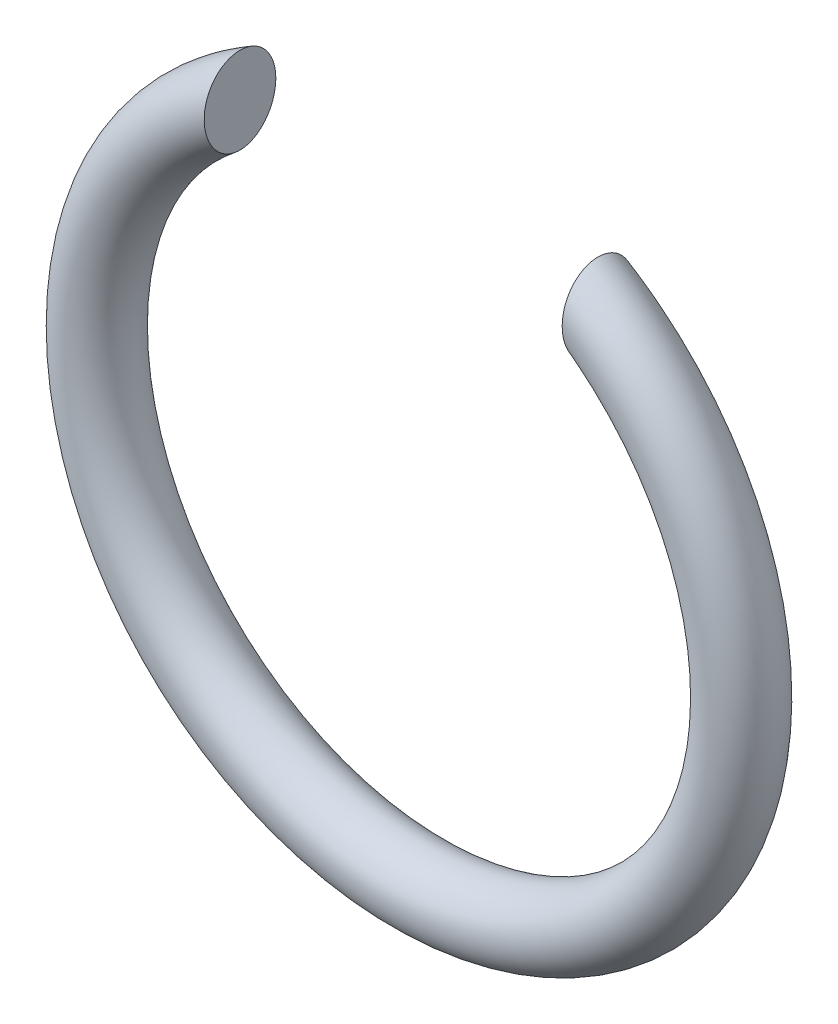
ISO-10303-21;
HEADER;
FILE_DESCRIPTION(('STEP AP214'),'2;1');
FILE_NAME('part.step','',(''),(''),'','','');
FILE_SCHEMA(('AUTOMOTIVE_DESIGN { 1 0 10303 214 1 1 1 1 }'));
ENDSEC;
DATA;
#1=APPLICATION_CONTEXT('core data for automotive mechanical design processes');
#2=APPLICATION_PROTOCOL_DEFINITION('international standard','automotive_design',2000,#1);
#3=PRODUCT_CONTEXT('',#1,'mechanical');
#4=PRODUCT('Part','Part','',(#3));
#5=PRODUCT_RELATED_PRODUCT_CATEGORY('part','',(#4));
#6=PRODUCT_DEFINITION_FORMATION('','',#4);
#7=PRODUCT_DEFINITION_CONTEXT('part definition',#1,'design');
#8=PRODUCT_DEFINITION('design','',#6,#7);
#9=PRODUCT_DEFINITION_SHAPE('','',#8);
#10=(LENGTH_UNIT() NAMED_UNIT(*) SI_UNIT(.MILLI.,.METRE.));
#11=(NAMED_UNIT(*) PLANE_ANGLE_UNIT() SI_UNIT($,.RADIAN.));
#12=(NAMED_UNIT(*) SI_UNIT($,.STERADIAN.) SOLID_ANGLE_UNIT());
#13=UNCERTAINTY_MEASURE_WITH_UNIT(LENGTH_MEASURE(1.E-05),#10,'distance_accuracy_value','');
#14=(GEOMETRIC_REPRESENTATION_CONTEXT(3) GLOBAL_UNCERTAINTY_ASSIGNED_CONTEXT((#13)) GLOBAL_UNIT_ASSIGNED_CONTEXT((#10,
#11,#12)) REPRESENTATION_CONTEXT('',''));
#15=CARTESIAN_POINT('',(0.,0.,0.));
#16=DIRECTION('',(0.,0.,1.));
#17=DIRECTION('',(1.,0.,0.));
#18=AXIS2_PLACEMENT_3D('',#15,#16,#17);
#19=CARTESIAN_POINT('',(0.,0.,0.));
#20=DIRECTION('',(0.,0.,-1.));
#21=DIRECTION('',(-1.,0.,0.));
#22=AXIS2_PLACEMENT_3D('',#19,#20,#21);
#23=TOROIDAL_SURFACE('',#22,3.6,0.4);
#24=CARTESIAN_POINT('',(2.,2.56295612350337,-0.195375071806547));
#25=CARTESIAN_POINT('',(2.,2.57790808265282,-0.216432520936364));
#26=CARTESIAN_POINT('',(2.,2.59494628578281,-0.236019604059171));
#27=CARTESIAN_POINT('',(2.,2.63214645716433,-0.271971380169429));
#28=CARTESIAN_POINT('',(2.,2.6523150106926,-0.288329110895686));
#29=CARTESIAN_POINT('',(2.,2.69475225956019,-0.3176080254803));
#30=CARTESIAN_POINT('',(2.,2.71700289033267,-0.330555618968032));
#31=CARTESIAN_POINT('',(2.,2.76308641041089,-0.353168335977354));
#32=CARTESIAN_POINT('',(2.,2.78691867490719,-0.362834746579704));
#33=CARTESIAN_POINT('',(2.,2.8399586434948,-0.380299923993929));
#34=CARTESIAN_POINT('',(2.,2.86937431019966,-0.387470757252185));
#35=CARTESIAN_POINT('',(2.,2.92897400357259,-0.397212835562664));
#36=CARTESIAN_POINT('',(2.,2.9591586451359,-0.39978027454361));
#37=CARTESIAN_POINT('',(2.,3.02213545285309,-0.400210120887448));
#38=CARTESIAN_POINT('',(2.,3.0549319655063,-0.397655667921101));
#39=CARTESIAN_POINT('',(2.,3.11958843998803,-0.386797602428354));
#40=CARTESIAN_POINT('',(2.,3.1514482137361,-0.378492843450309));
#41=CARTESIAN_POINT('',(2.,3.21154235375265,-0.356527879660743));
#42=CARTESIAN_POINT('',(2.,3.23987755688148,-0.343146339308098));
#43=CARTESIAN_POINT('',(2.,3.29333178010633,-0.311044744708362));
#44=CARTESIAN_POINT('',(2.,3.31845775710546,-0.292336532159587));
#45=CARTESIAN_POINT('',(2.,3.35743701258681,-0.25606439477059));
#46=CARTESIAN_POINT('',(2.,3.37244824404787,-0.239736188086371));
#47=CARTESIAN_POINT('',(2.,3.3995566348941,-0.204809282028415));
#48=CARTESIAN_POINT('',(2.,3.41165551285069,-0.186211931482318));
#49=CARTESIAN_POINT('',(2.,3.43244009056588,-0.147067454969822));
#50=CARTESIAN_POINT('',(2.,3.44110849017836,-0.126511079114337));
#51=CARTESIAN_POINT('',(2.,3.45447566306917,-0.0841416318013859));
#52=CARTESIAN_POINT('',(2.,3.45917601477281,-0.0623290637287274));
#53=CARTESIAN_POINT('',(2.,3.4640996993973,-0.0202111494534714));
#54=CARTESIAN_POINT('',(2.,3.46468974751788,5.19216316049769E-05));
#55=CARTESIAN_POINT('',(2.,3.46233366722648,0.0403674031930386));
#56=CARTESIAN_POINT('',(2.,3.45938845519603,0.0604198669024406));
#57=CARTESIAN_POINT('',(2.,3.45026212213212,0.0990828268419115));
#58=CARTESIAN_POINT('',(2.,3.44418853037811,0.117718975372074));
#59=CARTESIAN_POINT('',(2.,3.42913861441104,0.153774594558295));
#60=CARTESIAN_POINT('',(2.,3.42016193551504,0.171193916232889));
#61=CARTESIAN_POINT('',(2.,3.39916253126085,0.205252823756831));
#62=CARTESIAN_POINT('',(2.,3.38701400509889,0.221814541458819));
#63=CARTESIAN_POINT('',(2.,3.36036219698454,0.252913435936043));
#64=CARTESIAN_POINT('',(2.,3.34585805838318,0.267449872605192));
#65=CARTESIAN_POINT('',(2.,3.31325922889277,0.295784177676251));
#66=CARTESIAN_POINT('',(2.,3.29494557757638,0.309329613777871));
#67=CARTESIAN_POINT('',(2.,3.25654242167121,0.333601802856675));
#68=CARTESIAN_POINT('',(2.,3.23645203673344,0.344327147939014));
#69=CARTESIAN_POINT('',(2.,3.192029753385,0.36426690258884));
#70=CARTESIAN_POINT('',(2.,3.16750230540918,0.373045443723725));
#71=CARTESIAN_POINT('',(2.,3.11743460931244,0.386934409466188));
#72=CARTESIAN_POINT('',(2.,3.09189386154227,0.392043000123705));
#73=CARTESIAN_POINT('',(2.,3.03666174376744,0.399150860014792));
#74=CARTESIAN_POINT('',(2.,3.00689917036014,0.400600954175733));
#75=CARTESIAN_POINT('',(2.,2.94748721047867,0.39894983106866));
#76=CARTESIAN_POINT('',(2.,2.91783793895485,0.395844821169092));
#77=CARTESIAN_POINT('',(2.,2.85658757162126,0.384677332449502));
#78=CARTESIAN_POINT('',(2.,2.82506548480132,0.376175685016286));
#79=CARTESIAN_POINT('',(2.,2.76393176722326,0.353901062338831));
#80=CARTESIAN_POINT('',(2.,2.73431915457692,0.340130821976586));
#81=CARTESIAN_POINT('',(2.,2.68402694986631,0.310781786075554));
#82=CARTESIAN_POINT('',(2.,2.66277421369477,0.296183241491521));
#83=CARTESIAN_POINT('',(2.,2.62291110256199,0.263739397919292));
#84=CARTESIAN_POINT('',(2.,2.60429692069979,0.245898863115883));
#85=CARTESIAN_POINT('',(2.,2.57386531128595,0.21085445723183));
#86=CARTESIAN_POINT('',(2.,2.56142927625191,0.19418906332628));
#87=CARTESIAN_POINT('',(2.,2.53944863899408,0.159035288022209));
#88=CARTESIAN_POINT('',(2.,2.52990262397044,0.140547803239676));
#89=CARTESIAN_POINT('',(2.,2.51423652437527,0.10198623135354));
#90=CARTESIAN_POINT('',(2.,2.50814360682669,0.0819009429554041));
#91=CARTESIAN_POINT('',(2.,2.50000006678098,0.0409268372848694));
#92=CARTESIAN_POINT('',(2.,2.49794604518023,0.0200387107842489));
#93=CARTESIAN_POINT('',(2.,2.49804753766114,-0.0189975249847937));
#94=CARTESIAN_POINT('',(2.,2.49969056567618,-0.0371488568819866));
#95=CARTESIAN_POINT('',(2.,2.5060466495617,-0.0728991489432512));
#96=CARTESIAN_POINT('',(2.,2.51075919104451,-0.0904982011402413));
#97=CARTESIAN_POINT('',(2.,2.52242619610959,-0.123209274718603));
#98=CARTESIAN_POINT('',(2.,2.52915089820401,-0.138404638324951));
#99=CARTESIAN_POINT('',(2.,2.54461525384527,-0.167727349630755));
#100=CARTESIAN_POINT('',(2.,2.55335563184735,-0.18185431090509));
#101=CARTESIAN_POINT('',(2.,2.56295612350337,-0.195375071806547));
#102=B_SPLINE_CURVE_WITH_KNOTS('',3,(#24,#25,#26,#27,#28,#29,#30,#31,#32,#33,#34,#35,#36,#37,
#38,#39,#40,#41,#42,#43,#44,#45,#46,#47,#48,#49,#50,#51,#52,#53,#54,#55,#56,#57,#58,#59,#60,#61,
#62,#63,#64,#65,#66,#67,#68,#69,#70,#71,#72,#73,#74,#75,#76,#77,#78,#79,#80,#81,#82,#83,#84,#85,
#86,#87,#88,#89,#90,#91,#92,#93,#94,#95,#96,#97,#98,#99,#100,#101),.UNSPECIFIED.,.T.,.F.,(4,2,2,
2,2,2,2,2,2,2,2,2,2,2,2,2,2,2,2,2,2,2,2,2,2,2,2,2,2,2,2,2,2,2,2,2,2,2,4),(0.,0.0774046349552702,
0.154974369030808,0.231924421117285,0.308844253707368,0.399299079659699,0.489828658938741,
0.588024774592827,0.686240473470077,0.779702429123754,0.872958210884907,0.939225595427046,
1.00545377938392,1.07201182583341,1.13854338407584,1.19905306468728,1.25954706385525,
1.31808822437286,1.37663653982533,1.43800249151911,1.49939080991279,1.56745820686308,
1.63555952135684,1.71340649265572,1.79129233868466,1.88031716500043,1.96941615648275,
2.06690272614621,2.16433875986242,2.24140080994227,2.31835051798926,2.38048825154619,
2.44259555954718,2.50518494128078,2.567721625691,2.62212923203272,2.67652772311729,
2.72621051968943,2.77591120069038),.UNSPECIFIED.);
#103=CARTESIAN_POINT('',(2.,2.56295612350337,-0.195375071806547));
#104=VERTEX_POINT('',#103);
#105=EDGE_CURVE('E50',#104,#104,#102,.T.);
#106=ORIENTED_EDGE('',*,*,#105,.T.);
#107=EDGE_LOOP('',(#106));
#108=FACE_BOUND('',#107,.T.);
#109=CARTESIAN_POINT('',(-2.,2.56295612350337,-0.195375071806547));
#110=CARTESIAN_POINT('',(-2.,2.55193966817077,-0.179857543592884));
#111=CARTESIAN_POINT('',(-2.,2.54204416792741,-0.163527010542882));
#112=CARTESIAN_POINT('',(-2.,2.52496740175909,-0.129474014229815));
#113=CARTESIAN_POINT('',(-2.,2.51778852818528,-0.11175034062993));
#114=CARTESIAN_POINT('',(-2.,2.50656234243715,-0.0752266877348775));
#115=CARTESIAN_POINT('',(-2.,2.50253077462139,-0.0564217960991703));
#116=CARTESIAN_POINT('',(-2.,2.49795869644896,-0.0183982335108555));
#117=CARTESIAN_POINT('',(-2.,2.49741575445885,0.000820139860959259));
#118=CARTESIAN_POINT('',(-2.,2.49977165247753,0.03772719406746));
#119=CARTESIAN_POINT('',(-2.,2.50243954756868,0.0554312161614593));
#120=CARTESIAN_POINT('',(-2.,2.51065979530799,0.0901533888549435));
#121=CARTESIAN_POINT('',(-2.,2.5162128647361,0.107171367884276));
#122=CARTESIAN_POINT('',(-2.,2.53001598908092,0.140451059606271));
#123=CARTESIAN_POINT('',(-2.,2.53831608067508,0.156691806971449));
#124=CARTESIAN_POINT('',(-2.,2.55717886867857,0.187792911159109));
#125=CARTESIAN_POINT('',(-2.,2.56774239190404,0.202652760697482));
#126=CARTESIAN_POINT('',(-2.,2.59247761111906,0.232971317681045));
#127=CARTESIAN_POINT('',(-2.,2.60695333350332,0.248181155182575));
#128=CARTESIAN_POINT('',(-2.,2.63785244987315,0.276466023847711));
#129=CARTESIAN_POINT('',(-2.,2.65427708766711,0.289539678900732));
#130=CARTESIAN_POINT('',(-2.,2.69223194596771,0.316023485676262));
#131=CARTESIAN_POINT('',(-2.,2.71411176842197,0.328932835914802));
#132=CARTESIAN_POINT('',(-2.,2.75945922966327,0.35156548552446));
#133=CARTESIAN_POINT('',(-2.,2.7829279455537,0.361286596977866));
#134=CARTESIAN_POINT('',(-2.,2.8354417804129,0.379047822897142));
#135=CARTESIAN_POINT('',(-2.,2.86470948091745,0.386434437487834));
#136=CARTESIAN_POINT('',(-2.,2.92403907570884,0.396639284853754));
#137=CARTESIAN_POINT('',(-2.,2.95410143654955,0.399454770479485));
#138=CARTESIAN_POINT('',(-2.,3.01695411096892,0.400443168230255));
#139=CARTESIAN_POINT('',(-2.,3.04975270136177,0.398187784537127));
#140=CARTESIAN_POINT('',(-2.,3.11447264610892,0.387944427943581));
#141=CARTESIAN_POINT('',(-2.,3.14639376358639,0.379954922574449));
#142=CARTESIAN_POINT('',(-2.,3.20678285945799,0.358579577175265));
#143=CARTESIAN_POINT('',(-2.,3.23534159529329,0.345452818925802));
#144=CARTESIAN_POINT('',(-2.,3.28929661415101,0.313822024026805));
#145=CARTESIAN_POINT('',(-2.,3.31469968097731,0.295329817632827));
#146=CARTESIAN_POINT('',(-2.,3.35421229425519,0.259363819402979));
#147=CARTESIAN_POINT('',(-2.,3.36946499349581,0.243137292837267));
#148=CARTESIAN_POINT('',(-2.,3.39707116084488,0.208372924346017));
#149=CARTESIAN_POINT('',(-2.,3.40942633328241,0.189836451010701));
#150=CARTESIAN_POINT('',(-2.,3.43073071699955,0.150764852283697));
#151=CARTESIAN_POINT('',(-2.,3.43966233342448,0.130220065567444));
#152=CARTESIAN_POINT('',(-2.,3.45354572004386,0.0878227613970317));
#153=CARTESIAN_POINT('',(-2.,3.45849913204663,0.0659707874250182));
#154=CARTESIAN_POINT('',(-2.,3.46387619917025,0.0237686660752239));
#155=CARTESIAN_POINT('',(-2.,3.46467531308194,0.00346575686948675));
#156=CARTESIAN_POINT('',(-2.,3.46271772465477,-0.0369639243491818));
#157=CARTESIAN_POINT('',(-2.,3.45996199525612,-0.0570907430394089));
#158=CARTESIAN_POINT('',(-2.,3.45119190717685,-0.0958783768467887));
#159=CARTESIAN_POINT('',(-2.,3.4452940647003,-0.114565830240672));
#160=CARTESIAN_POINT('',(-2.,3.43057922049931,-0.150748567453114));
#161=CARTESIAN_POINT('',(-2.,3.42176188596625,-0.168243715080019));
#162=CARTESIAN_POINT('',(-2.,3.40108895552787,-0.202442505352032));
#163=CARTESIAN_POINT('',(-2.,3.38911210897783,-0.219072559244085));
#164=CARTESIAN_POINT('',(-2.,3.36278839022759,-0.250330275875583));
#165=CARTESIAN_POINT('',(-2.,3.34844066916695,-0.264957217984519));
#166=CARTESIAN_POINT('',(-2.,3.31617459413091,-0.293482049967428));
#167=CARTESIAN_POINT('',(-2.,3.29803824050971,-0.307132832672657));
#168=CARTESIAN_POINT('',(-2.,3.25997155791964,-0.331638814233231));
#169=CARTESIAN_POINT('',(-2.,3.24004034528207,-0.342492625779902));
#170=CARTESIAN_POINT('',(-2.,3.19594992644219,-0.362723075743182));
#171=CARTESIAN_POINT('',(-2.,3.17159302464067,-0.371668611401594));
#172=CARTESIAN_POINT('',(-2.,3.12184035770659,-0.385916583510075));
#173=CARTESIAN_POINT('',(-2.,3.09644406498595,-0.39121714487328));
#174=CARTESIAN_POINT('',(-2.,3.04147559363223,-0.398763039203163));
#175=CARTESIAN_POINT('',(-2.,3.01182763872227,-0.400460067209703));
#176=CARTESIAN_POINT('',(-2.,2.9526087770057,-0.399326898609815));
#177=CARTESIAN_POINT('',(-2.,2.9230379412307,-0.396493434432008));
#178=CARTESIAN_POINT('',(-2.,2.86184532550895,-0.385912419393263));
#179=CARTESIAN_POINT('',(-2.,2.83029967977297,-0.377718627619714));
#180=CARTESIAN_POINT('',(-2.,2.76903789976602,-0.356068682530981));
#181=CARTESIAN_POINT('',(-2.,2.73932191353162,-0.342612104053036));
#182=CARTESIAN_POINT('',(-2.,2.68869509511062,-0.313791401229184));
#183=CARTESIAN_POINT('',(-2.,2.66723241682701,-0.299393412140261));
#184=CARTESIAN_POINT('',(-2.,2.62694629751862,-0.267359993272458));
#185=CARTESIAN_POINT('',(-2.,2.60811323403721,-0.249736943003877));
#186=CARTESIAN_POINT('',(-2.,2.58104166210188,-0.219360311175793));
#187=CARTESIAN_POINT('',(-2.,2.57164984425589,-0.207620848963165));
#188=CARTESIAN_POINT('',(-2.,2.56295612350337,-0.195375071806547));
#189=B_SPLINE_CURVE_WITH_KNOTS('',3,(#109,#110,#111,#112,#113,#114,#115,#116,#117,#118,#119,
#120,#121,#122,#123,#124,#125,#126,#127,#128,#129,#130,#131,#132,#133,#134,#135,#136,#137,#138,
#139,#140,#141,#142,#143,#144,#145,#146,#147,#148,#149,#150,#151,#152,#153,#154,#155,#156,#157,
#158,#159,#160,#161,#162,#163,#164,#165,#166,#167,#168,#169,#170,#171,#172,#173,#174,#175,#176,
#177,#178,#179,#180,#181,#182,#183,#184,#185,#186,#187,#188),.UNSPECIFIED.,.T.,.F.,(4,2,2,2,2,2,
2,2,2,2,2,2,2,2,2,2,2,2,2,2,2,2,2,2,2,2,2,2,2,2,2,2,2,2,2,2,2,2,2,4),(0.,0.0570534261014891,
0.114156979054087,0.171544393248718,0.228891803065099,0.282349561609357,0.335820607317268,
0.390324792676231,0.444848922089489,0.507612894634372,0.570417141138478,0.646348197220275,
0.722331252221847,0.812511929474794,0.902746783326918,1.00088622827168,1.0990519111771,
1.19279904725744,1.28634103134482,1.35287745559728,1.4193746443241,1.48620914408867,
1.55301604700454,1.61366476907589,1.67429689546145,1.73282291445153,1.79135560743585,
1.85258469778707,1.91383575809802,1.981666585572,2.04953099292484,2.12706912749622,
2.20464712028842,2.29336991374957,2.38215672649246,2.47947930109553,2.5768097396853,
2.6540622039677,2.73102412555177,2.77604827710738),.UNSPECIFIED.);
#190=CARTESIAN_POINT('',(-2.,2.56295612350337,-0.195375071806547));
#191=VERTEX_POINT('',#190);
#192=EDGE_CURVE('E10',#191,#191,#189,.T.);
#193=ORIENTED_EDGE('',*,*,#192,.T.);
#194=EDGE_LOOP('',(#193));
#195=FACE_BOUND('',#194,.T.);
#196=ADVANCED_FACE('F40',(#108,#195),#23,.T.);
#197=CARTESIAN_POINT('',(2.,0.,-0.4));
#198=DIRECTION('',(1.,0.,0.));
#199=DIRECTION('',(0.,0.,-1.));
#200=AXIS2_PLACEMENT_3D('',#197,#198,#199);
#201=PLANE('',#200);
#202=ORIENTED_EDGE('',*,*,#105,.F.);
#203=EDGE_LOOP('',(#202));
#204=FACE_BOUND('',#203,.T.);
#205=ADVANCED_FACE('F60',(#204),#201,.F.);
#206=CARTESIAN_POINT('',(-2.,0.,-0.4));
#207=DIRECTION('',(-1.,0.,0.));
#208=DIRECTION('',(0.,0.,1.));
#209=AXIS2_PLACEMENT_3D('',#206,#207,#208);
#210=PLANE('',#209);
#211=ORIENTED_EDGE('',*,*,#192,.F.);
#212=EDGE_LOOP('',(#211));
#213=FACE_BOUND('',#212,.T.);
#214=ADVANCED_FACE('F58',(#213),#210,.F.);
#215=CLOSED_SHELL('',(#196,#205,#214));
#216=MANIFOLD_SOLID_BREP('B2',#215);
#217=ADVANCED_BREP_SHAPE_REPRESENTATION('',(#18,#216),#14);
#218=SHAPE_DEFINITION_REPRESENTATION(#9,#217);
ENDSEC;
END-ISO-10303-21;
